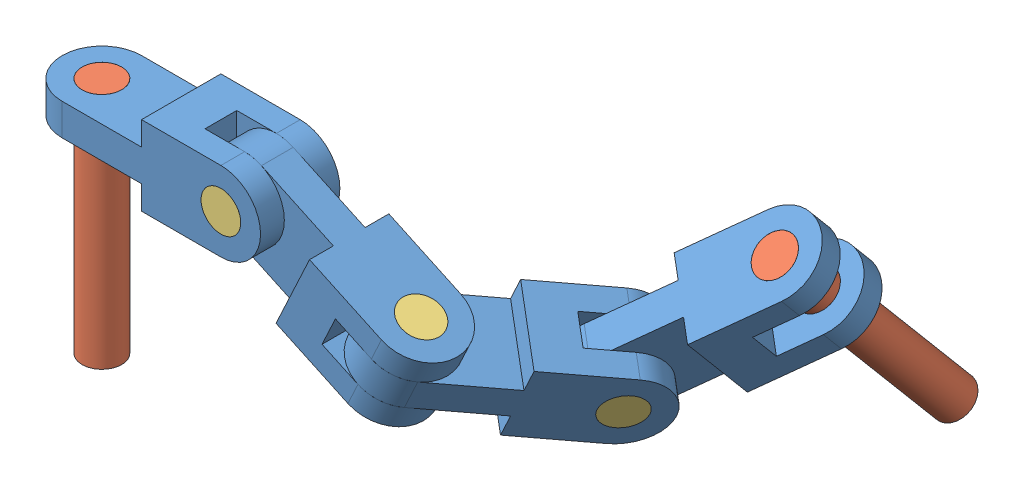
SolidWorks assembly part 3 - assembly.SLDASM, configuration Default (file format 13000). Lengths in mm.
Overall size (743.15 346.45 521.11).
9 component instances, 3 part files, 21 mates.
Components (placement in the parent):
- chain_link-1: chain_link.SLDPRT [Default] at (100 -20 0) x (0 -1 0) z (0 0 1) size (100 300 100)
- long_pin-1: long_pin.SLDPRT [Default] at origin size (50 300 50)
- short_pin-1: short_pin.SLDPRT [Default] at (200 -20 -50) x (1 0 0) z (0 1 0) size (50 100 50)
- short_pin-2: short_pin.SLDPRT [Default] at (402.3925 -59.2083 0) x (0.906308 -0.422618 0) z (0 0 1) size (50 100 50)
- chain_link-2: chain_link.SLDPRT [Default] at (433.2452 -128.764 -81.9152) x (-0.422618 -0.906308 0) z (0.742404 -0.346189 0.573576) size (100 300 100)
- chain_link-3: chain_link.SLDPRT [Default] at (290.6308 -62.2618 0) x (0 0 1) z (0.422618 0.906308 0) size (100 300 100)
- short_pin-4: short_pin.SLDPRT [Default] at (448.1087 -135.695 -192.5092) x (0.649738 0.16333 -0.742404) z (0.16333 0.923838 0.346189) size (50 100 50)
- chain_link-4: chain_link.SLDPRT [Default] at (551.0178 -99.1586 -216.4845) x (0.742404 -0.346189 0.573576) z (-0.126564 0.768256 0.627507) size (100 300 100)
- long_pin-2: long_pin.SLDPRT [Default] at (648.4478 -237.3768 -426.0153) x (-0.285566 -0.634032 0.718648) z (0.949965 -0.088239 0.299633) size (50 300 50)
Mates (geometry in assembly coordinates):
- Concentric1: concentric: cylinder of long_pin-1 through (0 -300 0) axis (0 1 0) radius 25
- Coincident4: coincident: plane of long_pin-1 through (0 0 0) normal (0 1 0)
- Concentric7: concentric anti-aligned: cylinder of chain_link-1 through (0 30 0) axis (0 -1 0) radius 25; cylinder of long_pin-1 through (0 -300 0) axis (0 1 0) radius 25
- Coincident6: coincident aligned: plane of chain_link-1 through (0 0 0) normal (0 1 0); plane of long_pin-1 through (0 0 0) normal (0 1 0)
- Concentric8: concentric anti-aligned: cylinder of chain_link-1 through (200 -20 -50) axis (0 0 1) radius 25; cylinder of short_pin-1 through (200 -20 50) axis (0 0 -1) radius 25
- Coincident7: coincident aligned: plane of chain_link-1 through (200 -20 50) normal (0 0 1); plane of short_pin-1 through (200 -20 50) normal (0 0 1)
- Concentric9: concentric anti-aligned: cylinder of short_pin-1 through (200 -20 50) axis (0 0 -1) radius 25; cylinder of chain_link-3 through (200 -20 -50) axis (0 0 1) radius 25
- Coincident8: coincident anti-aligned: plane of chain_link-1 through (250 30 20) normal (0 0 -1); plane of chain_link-3 through (200 -20 20) normal (0 0 1)
- Concentric10: concentric aligned: cylinder of short_pin-2 through (360.1306 -149.839 0) axis (0.422618 0.906308 0) radius 25; cylinder of chain_link-3 through (360.1306 -149.839 0) axis (0.422618 0.906308 0) radius 25
- Coincident9: coincident aligned: plane of short_pin-2 through (402.3925 -59.2083 0) normal (0.422618 0.906308 0); plane of chain_link-3 through (402.3925 -59.2083 0) normal (0.422618 0.906308 0)
- Concentric11: concentric anti-aligned: cylinder of short_pin-2 through (360.1306 -149.839 0) axis (0.422618 0.906308 0) radius 25; cylinder of chain_link-2 through (402.3925 -59.2082 0) axis (-0.422618 -0.906308 0) radius 25
- Coincident11: coincident anti-aligned: plane of chain_link-2 through (389.7139 -86.3975 0) normal (0.422618 0.906308 0); plane of chain_link-3 through (435.0293 -107.5284 -50) normal (-0.422618 -0.906308 0)
- Concentric12: concentric anti-aligned: cylinder of chain_link-2 through (448.1087 -135.695 -192.5092) axis (0.742404 -0.346189 0.573576) radius 25; cylinder of short_pin-4 through (522.3491 -170.3139 -135.1516) axis (-0.742404 0.346189 -0.573576) radius 25
- Coincident12: coincident aligned: plane of chain_link-2 through (522.3491 -170.3139 -135.1516) normal (0.742404 -0.346189 0.573576); plane of short_pin-4 through (522.3491 -170.3139 -135.1516) normal (0.742404 -0.346189 0.573576)
- Concentric13: concentric anti-aligned: cylinder of short_pin-4 through (522.3491 -170.3139 -135.1516) axis (-0.742404 0.346189 -0.573576) radius 25; cylinder of chain_link-4 through (448.1087 -135.695 -192.5092) axis (0.742404 -0.346189 0.573576) radius 25
- Coincident13: coincident anti-aligned: plane of chain_link-2 through (547.1997 -126.733 -193.3165) normal (-0.742404 0.346189 -0.573576); plane of chain_link-4 through (500.077 -159.9282 -152.3589) normal (0.742404 -0.346189 0.573576)
- Concentric14: concentric anti-aligned: cylinder of chain_link-4 through (623.1349 -83.7256 -300.5139) axis (-0.126564 0.768256 0.627507) radius 25; cylinder of long_pin-2 through (610.4785 -6.9001 -237.7632) axis (0.126564 -0.768256 -0.627507) radius 25
- Coincident14: coincident aligned: plane of chain_link-4 through (610.4785 -6.9001 -237.7632) normal (-0.126564 0.768256 0.627507); plane of long_pin-2 through (610.4785 -6.9001 -237.7632) normal (-0.126564 0.768256 0.627507)
- Angle1: planar angle = 0.436332 rad aligned: plane of chain_link-3 through (402.3925 -59.2083 0) normal (0.422618 0.906308 0)
- Angle2: planar angle = 0.959931 rad aligned: plane of chain_link-2 through (448.1087 -135.695 -192.5092) normal (-0.742404 0.346189 -0.573576); plane of chain_link-3 through (200 -20 -20) normal (0 0 -1)
- Angle3: planar angle = 0.872665 rad aligned: plane of chain_link-2 through (491.4963 -100.7581 -53.2364) normal (0.422618 0.906308 0); plane of chain_link-4 through (610.4785 -6.9001 -237.7632) normal (-0.126564 0.768256 0.627507)
